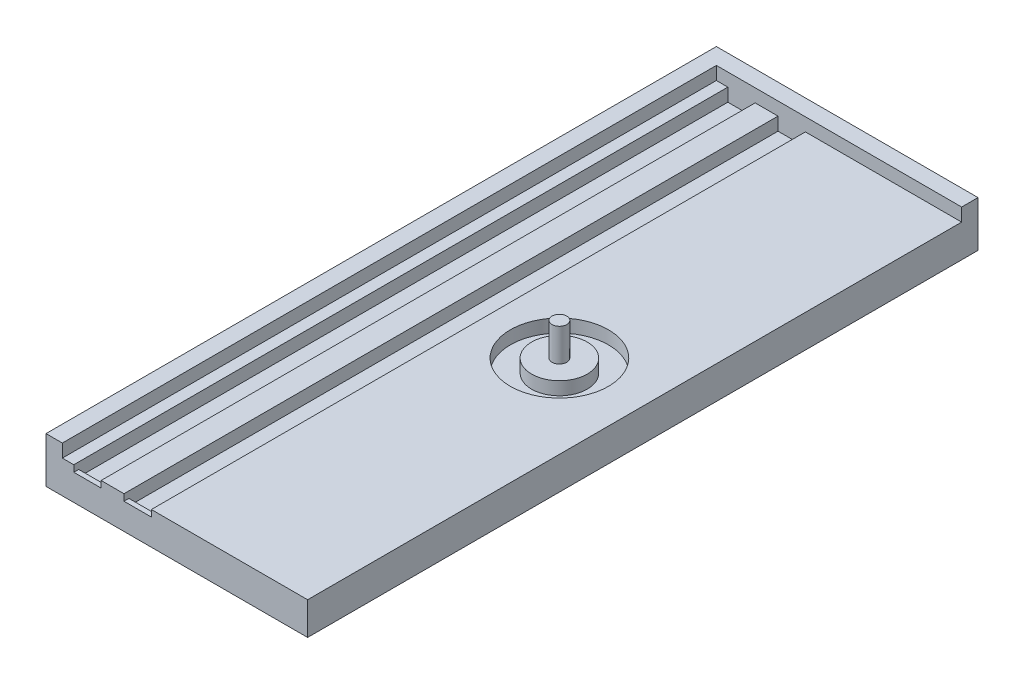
ISO-10303-21;
HEADER;
FILE_DESCRIPTION(('STEP AP214'),'2;1');
FILE_NAME('part.step','',(''),(''),'','','');
FILE_SCHEMA(('AUTOMOTIVE_DESIGN { 1 0 10303 214 1 1 1 1 }'));
ENDSEC;
DATA;
#1=APPLICATION_CONTEXT('core data for automotive mechanical design processes');
#2=APPLICATION_PROTOCOL_DEFINITION('international standard','automotive_design',2000,#1);
#3=PRODUCT_CONTEXT('',#1,'mechanical');
#4=PRODUCT('Part','Part','',(#3));
#5=PRODUCT_RELATED_PRODUCT_CATEGORY('part','',(#4));
#6=PRODUCT_DEFINITION_FORMATION('','',#4);
#7=PRODUCT_DEFINITION_CONTEXT('part definition',#1,'design');
#8=PRODUCT_DEFINITION('design','',#6,#7);
#9=PRODUCT_DEFINITION_SHAPE('','',#8);
#10=(LENGTH_UNIT() NAMED_UNIT(*) SI_UNIT(.MILLI.,.METRE.));
#11=(NAMED_UNIT(*) PLANE_ANGLE_UNIT() SI_UNIT($,.RADIAN.));
#12=(NAMED_UNIT(*) SI_UNIT($,.STERADIAN.) SOLID_ANGLE_UNIT());
#13=UNCERTAINTY_MEASURE_WITH_UNIT(LENGTH_MEASURE(1.E-05),#10,'distance_accuracy_value','');
#14=(GEOMETRIC_REPRESENTATION_CONTEXT(3) GLOBAL_UNCERTAINTY_ASSIGNED_CONTEXT((#13)) GLOBAL_UNIT_ASSIGNED_CONTEXT((#10,
#11,#12)) REPRESENTATION_CONTEXT('',''));
#15=CARTESIAN_POINT('',(0.,0.,0.));
#16=DIRECTION('',(0.,0.,1.));
#17=DIRECTION('',(1.,0.,0.));
#18=AXIS2_PLACEMENT_3D('',#15,#16,#17);
#19=CARTESIAN_POINT('',(0.,6.,0.));
#20=DIRECTION('',(0.,1.,0.));
#21=DIRECTION('',(0.,0.,1.));
#22=AXIS2_PLACEMENT_3D('',#19,#20,#21);
#23=PLANE('',#22);
#24=DIRECTION('',(0.,0.,1.));
#25=VECTOR('',#24,1.);
#26=CARTESIAN_POINT('',(-31.5,6.,-97.5));
#27=LINE('',#26,#25);
#28=CARTESIAN_POINT('',(-31.5,6.,-97.5));
#29=VERTEX_POINT('',#28);
#30=CARTESIAN_POINT('',(-31.5,6.,101.));
#31=VERTEX_POINT('',#30);
#32=EDGE_CURVE('E182',#29,#31,#27,.T.);
#33=ORIENTED_EDGE('',*,*,#32,.T.);
#34=DIRECTION('',(1.,0.,0.));
#35=VECTOR('',#34,1.);
#36=CARTESIAN_POINT('',(-31.5,6.,101.));
#37=LINE('',#36,#35);
#38=CARTESIAN_POINT('',(-23.15,6.,101.));
#39=VERTEX_POINT('',#38);
#40=EDGE_CURVE('E178',#31,#39,#37,.T.);
#41=ORIENTED_EDGE('',*,*,#40,.T.);
#42=DIRECTION('',(0.,0.,-1.));
#43=VECTOR('',#42,1.);
#44=CARTESIAN_POINT('',(-23.15,6.,-97.5));
#45=LINE('',#44,#43);
#46=CARTESIAN_POINT('',(-23.15,6.,-97.5));
#47=VERTEX_POINT('',#46);
#48=EDGE_CURVE('E172',#39,#47,#45,.T.);
#49=ORIENTED_EDGE('',*,*,#48,.T.);
#50=DIRECTION('',(-1.,0.,0.));
#51=VECTOR('',#50,1.);
#52=CARTESIAN_POINT('',(-31.5,6.,-97.5));
#53=LINE('',#52,#51);
#54=EDGE_CURVE('E176',#47,#29,#53,.T.);
#55=ORIENTED_EDGE('',*,*,#54,.T.);
#56=EDGE_LOOP('',(#33,#41,#49,#55));
#57=FACE_BOUND('',#56,.T.);
#58=ADVANCED_FACE('F41',(#57),#23,.T.);
#59=CARTESIAN_POINT('',(0.,10.,0.));
#60=DIRECTION('',(0.,1.,0.));
#61=DIRECTION('',(0.,0.,1.));
#62=AXIS2_PLACEMENT_3D('',#59,#60,#61);
#63=PLANE('',#62);
#64=DIRECTION('',(0.,0.,1.));
#65=VECTOR('',#64,1.);
#66=CARTESIAN_POINT('',(-31.5,10.,-97.5));
#67=LINE('',#66,#65);
#68=CARTESIAN_POINT('',(-31.5,10.,-97.5));
#69=VERTEX_POINT('',#68);
#70=CARTESIAN_POINT('',(-31.5,10.,102.5));
#71=VERTEX_POINT('',#70);
#72=EDGE_CURVE('E206',#69,#71,#67,.T.);
#73=ORIENTED_EDGE('',*,*,#72,.F.);
#74=DIRECTION('',(1.,0.,0.));
#75=VECTOR('',#74,1.);
#76=CARTESIAN_POINT('',(40.,10.,-97.5));
#77=LINE('',#76,#75);
#78=CARTESIAN_POINT('',(-35.,10.,-97.5));
#79=VERTEX_POINT('',#78);
#80=EDGE_CURVE('E253',#79,#69,#77,.T.);
#81=ORIENTED_EDGE('',*,*,#80,.F.);
#82=DIRECTION('',(0.,0.,-1.));
#83=VECTOR('',#82,1.);
#84=CARTESIAN_POINT('',(-35.,10.,-97.5));
#85=LINE('',#84,#83);
#86=CARTESIAN_POINT('',(-35.,10.,102.5));
#87=VERTEX_POINT('',#86);
#88=EDGE_CURVE('E213',#87,#79,#85,.T.);
#89=ORIENTED_EDGE('',*,*,#88,.F.);
#90=DIRECTION('',(1.,0.,0.));
#91=VECTOR('',#90,1.);
#92=CARTESIAN_POINT('',(40.,10.,102.5));
#93=LINE('',#92,#91);
#94=EDGE_CURVE('E290',#87,#71,#93,.T.);
#95=ORIENTED_EDGE('',*,*,#94,.T.);
#96=EDGE_LOOP('',(#73,#81,#89,#95));
#97=FACE_BOUND('',#96,.T.);
#98=ADVANCED_FACE('F490',(#97),#63,.T.);
#99=CARTESIAN_POINT('',(14.5,10.,0.));
#100=DIRECTION('',(0.,1.,0.));
#101=DIRECTION('',(0.,0.,1.));
#102=AXIS2_PLACEMENT_3D('',#99,#100,#101);
#103=CIRCLE('',#102,15.);
#104=CARTESIAN_POINT('',(14.5,10.,15.));
#105=VERTEX_POINT('',#104);
#106=EDGE_CURVE('E441',#105,#105,#103,.T.);
#107=ORIENTED_EDGE('',*,*,#106,.F.);
#108=EDGE_LOOP('',(#107));
#109=FACE_BOUND('',#108,.T.);
#110=DIRECTION('',(0.,0.,-1.));
#111=VECTOR('',#110,1.);
#112=CARTESIAN_POINT('',(-7.78000000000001,10.,102.5));
#113=LINE('',#112,#111);
#114=CARTESIAN_POINT('',(-7.78000000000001,10.,102.5));
#115=VERTEX_POINT('',#114);
#116=CARTESIAN_POINT('',(-7.78000000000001,10.,-97.5));
#117=VERTEX_POINT('',#116);
#118=EDGE_CURVE('E232',#115,#117,#113,.T.);
#119=ORIENTED_EDGE('',*,*,#118,.F.);
#120=CARTESIAN_POINT('',(40.,10.,102.5));
#121=VERTEX_POINT('',#120);
#122=EDGE_CURVE('E296',#115,#121,#93,.T.);
#123=ORIENTED_EDGE('',*,*,#122,.T.);
#124=DIRECTION('',(0.,0.,-1.));
#125=VECTOR('',#124,1.);
#126=CARTESIAN_POINT('',(40.,10.,102.5));
#127=LINE('',#126,#125);
#128=CARTESIAN_POINT('',(40.,10.,-97.4999999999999));
#129=VERTEX_POINT('',#128);
#130=EDGE_CURVE('E294',#121,#129,#127,.T.);
#131=ORIENTED_EDGE('',*,*,#130,.T.);
#132=EDGE_CURVE('E274',#117,#129,#77,.T.);
#133=ORIENTED_EDGE('',*,*,#132,.F.);
#134=EDGE_LOOP('',(#119,#123,#131,#133));
#135=FACE_BOUND('',#134,.T.);
#136=ADVANCED_FACE('F356',(#109,#135),#63,.T.);
#137=CARTESIAN_POINT('',(-40.,10.,102.5));
#138=DIRECTION('',(1.,0.,0.));
#139=DIRECTION('',(0.,0.,-1.));
#140=AXIS2_PLACEMENT_3D('',#137,#138,#139);
#141=PLANE('',#140);
#142=DIRECTION('',(0.,0.,1.));
#143=VECTOR('',#142,1.);
#144=CARTESIAN_POINT('',(-40.,0.,102.5));
#145=LINE('',#144,#143);
#146=CARTESIAN_POINT('',(-40.,0.,-102.5));
#147=VERTEX_POINT('',#146);
#148=CARTESIAN_POINT('',(-40.,0.,102.5));
#149=VERTEX_POINT('',#148);
#150=EDGE_CURVE('E289',#147,#149,#145,.T.);
#151=ORIENTED_EDGE('',*,*,#150,.T.);
#152=DIRECTION('',(0.,-1.,0.));
#153=VECTOR('',#152,1.);
#154=CARTESIAN_POINT('',(-40.,10.,102.5));
#155=LINE('',#154,#153);
#156=CARTESIAN_POINT('',(-40.,14.,102.5));
#157=VERTEX_POINT('',#156);
#158=EDGE_CURVE('E45',#157,#149,#155,.T.);
#159=ORIENTED_EDGE('',*,*,#158,.F.);
#160=DIRECTION('',(0.,0.,1.));
#161=VECTOR('',#160,1.);
#162=CARTESIAN_POINT('',(-40.,14.,-102.5));
#163=LINE('',#162,#161);
#164=CARTESIAN_POINT('',(-40.,14.,-102.5));
#165=VERTEX_POINT('',#164);
#166=EDGE_CURVE('E257',#165,#157,#163,.T.);
#167=ORIENTED_EDGE('',*,*,#166,.F.);
#168=DIRECTION('',(0.,-1.,0.));
#169=VECTOR('',#168,1.);
#170=CARTESIAN_POINT('',(-40.,10.,-102.5));
#171=LINE('',#170,#169);
#172=EDGE_CURVE('E300',#165,#147,#171,.T.);
#173=ORIENTED_EDGE('',*,*,#172,.T.);
#174=EDGE_LOOP('',(#151,#159,#167,#173));
#175=FACE_BOUND('',#174,.T.);
#176=ADVANCED_FACE('F43',(#175),#141,.F.);
#177=CARTESIAN_POINT('',(40.,10.,102.5));
#178=DIRECTION('',(0.,0.,-1.));
#179=DIRECTION('',(-1.,0.,0.));
#180=AXIS2_PLACEMENT_3D('',#177,#178,#179);
#181=PLANE('',#180);
#182=DIRECTION('',(-1.,0.,0.));
#183=VECTOR('',#182,1.);
#184=CARTESIAN_POINT('',(-31.5,8.,102.5));
#185=LINE('',#184,#183);
#186=CARTESIAN_POINT('',(-23.15,8.,102.5));
#187=VERTEX_POINT('',#186);
#188=CARTESIAN_POINT('',(-31.5,8.,102.5));
#189=VERTEX_POINT('',#188);
#190=EDGE_CURVE('E415',#187,#189,#185,.T.);
#191=ORIENTED_EDGE('',*,*,#190,.T.);
#192=DIRECTION('',(0.,1.,0.));
#193=VECTOR('',#192,1.);
#194=CARTESIAN_POINT('',(-31.5,6.,102.5));
#195=LINE('',#194,#193);
#196=EDGE_CURVE('E63',#189,#71,#195,.T.);
#197=ORIENTED_EDGE('',*,*,#196,.T.);
#198=ORIENTED_EDGE('',*,*,#94,.F.);
#199=DIRECTION('',(0.,-1.,0.));
#200=VECTOR('',#199,1.);
#201=CARTESIAN_POINT('',(-35.,14.,102.5));
#202=LINE('',#201,#200);
#203=CARTESIAN_POINT('',(-35.,14.,102.5));
#204=VERTEX_POINT('',#203);
#205=EDGE_CURVE('E285',#204,#87,#202,.T.);
#206=ORIENTED_EDGE('',*,*,#205,.F.);
#207=DIRECTION('',(1.,0.,0.));
#208=VECTOR('',#207,1.);
#209=CARTESIAN_POINT('',(-35.,14.,102.5));
#210=LINE('',#209,#208);
#211=EDGE_CURVE('E261',#157,#204,#210,.T.);
#212=ORIENTED_EDGE('',*,*,#211,.F.);
#213=ORIENTED_EDGE('',*,*,#158,.T.);
#214=DIRECTION('',(1.,0.,0.));
#215=VECTOR('',#214,1.);
#216=CARTESIAN_POINT('',(40.,0.,102.5));
#217=LINE('',#216,#215);
#218=CARTESIAN_POINT('',(40.,0.,102.5));
#219=VERTEX_POINT('',#218);
#220=EDGE_CURVE('E304',#149,#219,#217,.T.);
#221=ORIENTED_EDGE('',*,*,#220,.T.);
#222=DIRECTION('',(0.,-1.,0.));
#223=VECTOR('',#222,1.);
#224=CARTESIAN_POINT('',(40.,10.,102.5));
#225=LINE('',#224,#223);
#226=EDGE_CURVE('E319',#121,#219,#225,.T.);
#227=ORIENTED_EDGE('',*,*,#226,.F.);
#228=ORIENTED_EDGE('',*,*,#122,.F.);
#229=DIRECTION('',(0.,1.,0.));
#230=VECTOR('',#229,1.);
#231=CARTESIAN_POINT('',(-7.78000000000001,6.,102.5));
#232=LINE('',#231,#230);
#233=CARTESIAN_POINT('',(-7.78000000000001,8.,102.5));
#234=VERTEX_POINT('',#233);
#235=EDGE_CURVE('E224',#234,#115,#232,.T.);
#236=ORIENTED_EDGE('',*,*,#235,.F.);
#237=DIRECTION('',(-1.,0.,0.));
#238=VECTOR('',#237,1.);
#239=CARTESIAN_POINT('',(-16.15,8.,102.5));
#240=LINE('',#239,#238);
#241=CARTESIAN_POINT('',(-16.15,8.,102.5));
#242=VERTEX_POINT('',#241);
#243=EDGE_CURVE('E372',#234,#242,#240,.T.);
#244=ORIENTED_EDGE('',*,*,#243,.T.);
#245=DIRECTION('',(0.,1.,0.));
#246=VECTOR('',#245,1.);
#247=CARTESIAN_POINT('',(-16.15,6.,102.5));
#248=LINE('',#247,#246);
#249=CARTESIAN_POINT('',(-16.15,10.,102.5));
#250=VERTEX_POINT('',#249);
#251=EDGE_CURVE('E221',#242,#250,#248,.T.);
#252=ORIENTED_EDGE('',*,*,#251,.T.);
#253=CARTESIAN_POINT('',(-23.15,10.,102.5));
#254=VERTEX_POINT('',#253);
#255=EDGE_CURVE('E295',#254,#250,#93,.T.);
#256=ORIENTED_EDGE('',*,*,#255,.F.);
#257=DIRECTION('',(0.,1.,0.));
#258=VECTOR('',#257,1.);
#259=CARTESIAN_POINT('',(-23.15,6.,102.5));
#260=LINE('',#259,#258);
#261=EDGE_CURVE('E194',#187,#254,#260,.T.);
#262=ORIENTED_EDGE('',*,*,#261,.F.);
#263=EDGE_LOOP('',(#191,#197,#198,#206,#212,#213,#221,#227,#228,#236,#244,#252,#256,#262));
#264=FACE_BOUND('',#263,.T.);
#265=ADVANCED_FACE('F333',(#264),#181,.F.);
#266=CARTESIAN_POINT('',(40.,10.,102.5));
#267=DIRECTION('',(-1.,0.,0.));
#268=DIRECTION('',(0.,0.,1.));
#269=AXIS2_PLACEMENT_3D('',#266,#267,#268);
#270=PLANE('',#269);
#271=DIRECTION('',(0.,0.,-1.));
#272=VECTOR('',#271,1.);
#273=CARTESIAN_POINT('',(40.,0.,102.5));
#274=LINE('',#273,#272);
#275=CARTESIAN_POINT('',(40.,0.,-102.5));
#276=VERTEX_POINT('',#275);
#277=EDGE_CURVE('E307',#219,#276,#274,.T.);
#278=ORIENTED_EDGE('',*,*,#277,.T.);
#279=DIRECTION('',(0.,-1.,0.));
#280=VECTOR('',#279,1.);
#281=CARTESIAN_POINT('',(40.,10.,-102.5));
#282=LINE('',#281,#280);
#283=CARTESIAN_POINT('',(40.,14.,-102.5));
#284=VERTEX_POINT('',#283);
#285=EDGE_CURVE('E316',#284,#276,#282,.T.);
#286=ORIENTED_EDGE('',*,*,#285,.F.);
#287=DIRECTION('',(0.,0.,-1.));
#288=VECTOR('',#287,1.);
#289=CARTESIAN_POINT('',(40.,14.,-97.5));
#290=LINE('',#289,#288);
#291=CARTESIAN_POINT('',(40.,14.,-97.5));
#292=VERTEX_POINT('',#291);
#293=EDGE_CURVE('E248',#292,#284,#290,.T.);
#294=ORIENTED_EDGE('',*,*,#293,.F.);
#295=DIRECTION('',(0.,-1.,0.));
#296=VECTOR('',#295,1.);
#297=CARTESIAN_POINT('',(40.,14.,-97.5));
#298=LINE('',#297,#296);
#299=EDGE_CURVE('E270',#292,#129,#298,.T.);
#300=ORIENTED_EDGE('',*,*,#299,.T.);
#301=ORIENTED_EDGE('',*,*,#130,.F.);
#302=ORIENTED_EDGE('',*,*,#226,.T.);
#303=EDGE_LOOP('',(#278,#286,#294,#300,#301,#302));
#304=FACE_BOUND('',#303,.T.);
#305=ADVANCED_FACE('F341',(#304),#270,.F.);
#306=CARTESIAN_POINT('',(40.,10.,-102.5));
#307=DIRECTION('',(0.,0.,1.));
#308=DIRECTION('',(1.,0.,0.));
#309=AXIS2_PLACEMENT_3D('',#306,#307,#308);
#310=PLANE('',#309);
#311=DIRECTION('',(-1.,0.,0.));
#312=VECTOR('',#311,1.);
#313=CARTESIAN_POINT('',(40.,0.,-102.5));
#314=LINE('',#313,#312);
#315=EDGE_CURVE('E310',#276,#147,#314,.T.);
#316=ORIENTED_EDGE('',*,*,#315,.T.);
#317=ORIENTED_EDGE('',*,*,#172,.F.);
#318=DIRECTION('',(-1.,0.,0.));
#319=VECTOR('',#318,1.);
#320=CARTESIAN_POINT('',(40.,14.,-102.5));
#321=LINE('',#320,#319);
#322=EDGE_CURVE('E252',#284,#165,#321,.T.);
#323=ORIENTED_EDGE('',*,*,#322,.F.);
#324=ORIENTED_EDGE('',*,*,#285,.T.);
#325=EDGE_LOOP('',(#316,#317,#323,#324));
#326=FACE_BOUND('',#325,.T.);
#327=ADVANCED_FACE('F345',(#326),#310,.F.);
#328=DIRECTION('',(0.,0.,-1.));
#329=VECTOR('',#328,1.);
#330=CARTESIAN_POINT('',(-23.15,10.,-97.5));
#331=LINE('',#330,#329);
#332=CARTESIAN_POINT('',(-23.15,10.,-97.5));
#333=VERTEX_POINT('',#332);
#334=EDGE_CURVE('E188',#254,#333,#331,.T.);
#335=ORIENTED_EDGE('',*,*,#334,.F.);
#336=ORIENTED_EDGE('',*,*,#255,.T.);
#337=DIRECTION('',(0.,0.,1.));
#338=VECTOR('',#337,1.);
#339=CARTESIAN_POINT('',(-16.15,10.,-97.5));
#340=LINE('',#339,#338);
#341=CARTESIAN_POINT('',(-16.15,10.,-97.5));
#342=VERTEX_POINT('',#341);
#343=EDGE_CURVE('E209',#342,#250,#340,.T.);
#344=ORIENTED_EDGE('',*,*,#343,.F.);
#345=EDGE_CURVE('E277',#333,#342,#77,.T.);
#346=ORIENTED_EDGE('',*,*,#345,.F.);
#347=EDGE_LOOP('',(#335,#336,#344,#346));
#348=FACE_BOUND('',#347,.T.);
#349=ADVANCED_FACE('F367',(#348),#63,.T.);
#350=CARTESIAN_POINT('',(0.,0.,0.));
#351=DIRECTION('',(0.,1.,0.));
#352=DIRECTION('',(0.,0.,1.));
#353=AXIS2_PLACEMENT_3D('',#350,#351,#352);
#354=PLANE('',#353);
#355=ORIENTED_EDGE('',*,*,#150,.F.);
#356=ORIENTED_EDGE('',*,*,#315,.F.);
#357=ORIENTED_EDGE('',*,*,#277,.F.);
#358=ORIENTED_EDGE('',*,*,#220,.F.);
#359=EDGE_LOOP('',(#355,#356,#357,#358));
#360=FACE_BOUND('',#359,.T.);
#361=ADVANCED_FACE('F340',(#360),#354,.F.);
#362=CARTESIAN_POINT('',(-35.,14.,-97.5));
#363=DIRECTION('',(-1.,0.,0.));
#364=DIRECTION('',(0.,0.,1.));
#365=AXIS2_PLACEMENT_3D('',#362,#363,#364);
#366=PLANE('',#365);
#367=ORIENTED_EDGE('',*,*,#88,.T.);
#368=DIRECTION('',(0.,-1.,0.));
#369=VECTOR('',#368,1.);
#370=CARTESIAN_POINT('',(-35.,14.,-97.5));
#371=LINE('',#370,#369);
#372=CARTESIAN_POINT('',(-35.,14.,-97.5));
#373=VERTEX_POINT('',#372);
#374=EDGE_CURVE('E281',#373,#79,#371,.T.);
#375=ORIENTED_EDGE('',*,*,#374,.F.);
#376=DIRECTION('',(0.,0.,-1.));
#377=VECTOR('',#376,1.);
#378=CARTESIAN_POINT('',(-35.,14.,-97.5));
#379=LINE('',#378,#377);
#380=EDGE_CURVE('E264',#204,#373,#379,.T.);
#381=ORIENTED_EDGE('',*,*,#380,.F.);
#382=ORIENTED_EDGE('',*,*,#205,.T.);
#383=EDGE_LOOP('',(#367,#375,#381,#382));
#384=FACE_BOUND('',#383,.T.);
#385=ADVANCED_FACE('F519',(#384),#366,.F.);
#386=CARTESIAN_POINT('',(40.,14.,-97.5));
#387=DIRECTION('',(0.,0.,-1.));
#388=DIRECTION('',(-1.,0.,0.));
#389=AXIS2_PLACEMENT_3D('',#386,#387,#388);
#390=PLANE('',#389);
#391=ORIENTED_EDGE('',*,*,#80,.T.);
#392=DIRECTION('',(0.,1.,0.));
#393=VECTOR('',#392,1.);
#394=CARTESIAN_POINT('',(-31.5,6.,-97.5));
#395=LINE('',#394,#393);
#396=EDGE_CURVE('E193',#29,#69,#395,.T.);
#397=ORIENTED_EDGE('',*,*,#396,.F.);
#398=ORIENTED_EDGE('',*,*,#54,.F.);
#399=DIRECTION('',(0.,1.,0.));
#400=VECTOR('',#399,1.);
#401=CARTESIAN_POINT('',(-23.15,6.,-97.5));
#402=LINE('',#401,#400);
#403=EDGE_CURVE('E185',#47,#333,#402,.T.);
#404=ORIENTED_EDGE('',*,*,#403,.T.);
#405=ORIENTED_EDGE('',*,*,#345,.T.);
#406=DIRECTION('',(0.,1.,0.));
#407=VECTOR('',#406,1.);
#408=CARTESIAN_POINT('',(-16.15,6.,-97.5));
#409=LINE('',#408,#407);
#410=CARTESIAN_POINT('',(-16.15,6.,-97.5));
#411=VERTEX_POINT('',#410);
#412=EDGE_CURVE('E217',#411,#342,#409,.T.);
#413=ORIENTED_EDGE('',*,*,#412,.F.);
#414=DIRECTION('',(-1.,0.,0.));
#415=VECTOR('',#414,1.);
#416=CARTESIAN_POINT('',(-7.78000000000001,6.,-97.5));
#417=LINE('',#416,#415);
#418=CARTESIAN_POINT('',(-7.78000000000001,6.,-97.5));
#419=VERTEX_POINT('',#418);
#420=EDGE_CURVE('E235',#419,#411,#417,.T.);
#421=ORIENTED_EDGE('',*,*,#420,.F.);
#422=DIRECTION('',(0.,1.,0.));
#423=VECTOR('',#422,1.);
#424=CARTESIAN_POINT('',(-7.78000000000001,6.,-97.5));
#425=LINE('',#424,#423);
#426=EDGE_CURVE('E227',#419,#117,#425,.T.);
#427=ORIENTED_EDGE('',*,*,#426,.T.);
#428=ORIENTED_EDGE('',*,*,#132,.T.);
#429=ORIENTED_EDGE('',*,*,#299,.F.);
#430=DIRECTION('',(1.,0.,0.));
#431=VECTOR('',#430,1.);
#432=CARTESIAN_POINT('',(40.,14.,-97.5));
#433=LINE('',#432,#431);
#434=EDGE_CURVE('E267',#373,#292,#433,.T.);
#435=ORIENTED_EDGE('',*,*,#434,.F.);
#436=ORIENTED_EDGE('',*,*,#374,.T.);
#437=EDGE_LOOP('',(#391,#397,#398,#404,#405,#413,#421,#427,#428,#429,#435,#436));
#438=FACE_BOUND('',#437,.T.);
#439=ADVANCED_FACE('F197',(#438),#390,.F.);
#440=CARTESIAN_POINT('',(0.,14.,0.));
#441=DIRECTION('',(0.,1.,0.));
#442=DIRECTION('',(0.,0.,1.));
#443=AXIS2_PLACEMENT_3D('',#440,#441,#442);
#444=PLANE('',#443);
#445=ORIENTED_EDGE('',*,*,#293,.T.);
#446=ORIENTED_EDGE('',*,*,#322,.T.);
#447=ORIENTED_EDGE('',*,*,#166,.T.);
#448=ORIENTED_EDGE('',*,*,#211,.T.);
#449=ORIENTED_EDGE('',*,*,#380,.T.);
#450=ORIENTED_EDGE('',*,*,#434,.T.);
#451=EDGE_LOOP('',(#445,#446,#447,#448,#449,#450));
#452=FACE_BOUND('',#451,.T.);
#453=ADVANCED_FACE('F347',(#452),#444,.T.);
#454=CARTESIAN_POINT('',(-7.78000000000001,6.,102.5));
#455=DIRECTION('',(1.,0.,0.));
#456=DIRECTION('',(0.,0.,-1.));
#457=AXIS2_PLACEMENT_3D('',#454,#455,#456);
#458=PLANE('',#457);
#459=DIRECTION('',(0.,1.,0.));
#460=VECTOR('',#459,1.);
#461=CARTESIAN_POINT('',(-7.78000000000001,6.,101.));
#462=LINE('',#461,#460);
#463=CARTESIAN_POINT('',(-7.78000000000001,6.,101.));
#464=VERTEX_POINT('',#463);
#465=CARTESIAN_POINT('',(-7.78000000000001,8.,101.));
#466=VERTEX_POINT('',#465);
#467=EDGE_CURVE('E420',#464,#466,#462,.T.);
#468=ORIENTED_EDGE('',*,*,#467,.T.);
#469=DIRECTION('',(0.,0.,1.));
#470=VECTOR('',#469,1.);
#471=CARTESIAN_POINT('',(-7.78000000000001,8.,101.));
#472=LINE('',#471,#470);
#473=EDGE_CURVE('E408',#466,#234,#472,.T.);
#474=ORIENTED_EDGE('',*,*,#473,.T.);
#475=ORIENTED_EDGE('',*,*,#235,.T.);
#476=ORIENTED_EDGE('',*,*,#118,.T.);
#477=ORIENTED_EDGE('',*,*,#426,.F.);
#478=DIRECTION('',(0.,0.,-1.));
#479=VECTOR('',#478,1.);
#480=CARTESIAN_POINT('',(-7.78000000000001,6.,102.5));
#481=LINE('',#480,#479);
#482=EDGE_CURVE('E220',#464,#419,#481,.T.);
#483=ORIENTED_EDGE('',*,*,#482,.F.);
#484=EDGE_LOOP('',(#468,#474,#475,#476,#477,#483));
#485=FACE_BOUND('',#484,.T.);
#486=ADVANCED_FACE('F406',(#485),#458,.F.);
#487=CARTESIAN_POINT('',(-16.15,6.,-97.5));
#488=DIRECTION('',(-1.,0.,0.));
#489=DIRECTION('',(0.,0.,1.));
#490=AXIS2_PLACEMENT_3D('',#487,#488,#489);
#491=PLANE('',#490);
#492=ORIENTED_EDGE('',*,*,#251,.F.);
#493=DIRECTION('',(0.,0.,1.));
#494=VECTOR('',#493,1.);
#495=CARTESIAN_POINT('',(-16.15,8.,101.));
#496=LINE('',#495,#494);
#497=CARTESIAN_POINT('',(-16.15,8.,101.));
#498=VERTEX_POINT('',#497);
#499=EDGE_CURVE('E413',#498,#242,#496,.T.);
#500=ORIENTED_EDGE('',*,*,#499,.F.);
#501=DIRECTION('',(0.,-1.,0.));
#502=VECTOR('',#501,1.);
#503=CARTESIAN_POINT('',(-16.15,6.,101.));
#504=LINE('',#503,#502);
#505=CARTESIAN_POINT('',(-16.15,6.,101.));
#506=VERTEX_POINT('',#505);
#507=EDGE_CURVE('E426',#498,#506,#504,.T.);
#508=ORIENTED_EDGE('',*,*,#507,.T.);
#509=DIRECTION('',(0.,0.,1.));
#510=VECTOR('',#509,1.);
#511=CARTESIAN_POINT('',(-16.15,6.,-97.5));
#512=LINE('',#511,#510);
#513=EDGE_CURVE('E241',#411,#506,#512,.T.);
#514=ORIENTED_EDGE('',*,*,#513,.F.);
#515=ORIENTED_EDGE('',*,*,#412,.T.);
#516=ORIENTED_EDGE('',*,*,#343,.T.);
#517=EDGE_LOOP('',(#492,#500,#508,#514,#515,#516));
#518=FACE_BOUND('',#517,.T.);
#519=ADVANCED_FACE('F375',(#518),#491,.F.);
#520=CARTESIAN_POINT('',(0.,6.,0.));
#521=DIRECTION('',(0.,1.,0.));
#522=DIRECTION('',(0.,0.,1.));
#523=AXIS2_PLACEMENT_3D('',#520,#521,#522);
#524=PLANE('',#523);
#525=DIRECTION('',(1.,0.,0.));
#526=VECTOR('',#525,1.);
#527=CARTESIAN_POINT('',(-7.78000000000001,6.,101.));
#528=LINE('',#527,#526);
#529=EDGE_CURVE('E403',#506,#464,#528,.T.);
#530=ORIENTED_EDGE('',*,*,#529,.T.);
#531=ORIENTED_EDGE('',*,*,#482,.T.);
#532=ORIENTED_EDGE('',*,*,#420,.T.);
#533=ORIENTED_EDGE('',*,*,#513,.T.);
#534=EDGE_LOOP('',(#530,#531,#532,#533));
#535=FACE_BOUND('',#534,.T.);
#536=ADVANCED_FACE('F400',(#535),#524,.T.);
#537=CARTESIAN_POINT('',(-31.5,6.,-97.5));
#538=DIRECTION('',(-1.,0.,0.));
#539=DIRECTION('',(0.,0.,1.));
#540=AXIS2_PLACEMENT_3D('',#537,#538,#539);
#541=PLANE('',#540);
#542=ORIENTED_EDGE('',*,*,#196,.F.);
#543=DIRECTION('',(0.,0.,1.));
#544=VECTOR('',#543,1.);
#545=CARTESIAN_POINT('',(-31.5,8.,101.));
#546=LINE('',#545,#544);
#547=CARTESIAN_POINT('',(-31.5,8.,101.));
#548=VERTEX_POINT('',#547);
#549=EDGE_CURVE('E58',#548,#189,#546,.T.);
#550=ORIENTED_EDGE('',*,*,#549,.F.);
#551=DIRECTION('',(0.,-1.,0.));
#552=VECTOR('',#551,1.);
#553=CARTESIAN_POINT('',(-31.5,6.,101.));
#554=LINE('',#553,#552);
#555=EDGE_CURVE('E455',#548,#31,#554,.T.);
#556=ORIENTED_EDGE('',*,*,#555,.T.);
#557=ORIENTED_EDGE('',*,*,#32,.F.);
#558=ORIENTED_EDGE('',*,*,#396,.T.);
#559=ORIENTED_EDGE('',*,*,#72,.T.);
#560=EDGE_LOOP('',(#542,#550,#556,#557,#558,#559));
#561=FACE_BOUND('',#560,.T.);
#562=ADVANCED_FACE('F506',(#561),#541,.F.);
#563=CARTESIAN_POINT('',(-23.15,6.,-97.5));
#564=DIRECTION('',(1.,0.,0.));
#565=DIRECTION('',(0.,0.,-1.));
#566=AXIS2_PLACEMENT_3D('',#563,#564,#565);
#567=PLANE('',#566);
#568=DIRECTION('',(0.,1.,0.));
#569=VECTOR('',#568,1.);
#570=CARTESIAN_POINT('',(-23.15,6.,101.));
#571=LINE('',#570,#569);
#572=CARTESIAN_POINT('',(-23.15,8.,101.));
#573=VERTEX_POINT('',#572);
#574=EDGE_CURVE('E457',#39,#573,#571,.T.);
#575=ORIENTED_EDGE('',*,*,#574,.T.);
#576=DIRECTION('',(0.,0.,1.));
#577=VECTOR('',#576,1.);
#578=CARTESIAN_POINT('',(-23.15,8.,101.));
#579=LINE('',#578,#577);
#580=EDGE_CURVE('E748',#573,#187,#579,.T.);
#581=ORIENTED_EDGE('',*,*,#580,.T.);
#582=ORIENTED_EDGE('',*,*,#261,.T.);
#583=ORIENTED_EDGE('',*,*,#334,.T.);
#584=ORIENTED_EDGE('',*,*,#403,.F.);
#585=ORIENTED_EDGE('',*,*,#48,.F.);
#586=EDGE_LOOP('',(#575,#581,#582,#583,#584,#585));
#587=FACE_BOUND('',#586,.T.);
#588=ADVANCED_FACE('F186',(#587),#567,.F.);
#589=CARTESIAN_POINT('',(14.5,6.,0.));
#590=DIRECTION('',(0.,1.,0.));
#591=DIRECTION('',(0.,0.,1.));
#592=AXIS2_PLACEMENT_3D('',#589,#590,#591);
#593=CYLINDRICAL_SURFACE('',#592,15.);
#594=CARTESIAN_POINT('',(14.5,6.,0.));
#595=DIRECTION('',(0.,1.,0.));
#596=DIRECTION('',(0.,0.,1.));
#597=AXIS2_PLACEMENT_3D('',#594,#595,#596);
#598=CIRCLE('',#597,15.);
#599=CARTESIAN_POINT('',(14.5,6.,15.));
#600=VERTEX_POINT('',#599);
#601=EDGE_CURVE('E231',#600,#600,#598,.T.);
#602=ORIENTED_EDGE('',*,*,#601,.F.);
#603=EDGE_LOOP('',(#602));
#604=FACE_BOUND('',#603,.T.);
#605=ORIENTED_EDGE('',*,*,#106,.T.);
#606=EDGE_LOOP('',(#605));
#607=FACE_BOUND('',#606,.T.);
#608=ADVANCED_FACE('F502',(#604,#607),#593,.F.);
#609=CARTESIAN_POINT('',(14.5,6.,0.));
#610=DIRECTION('',(0.,1.,0.));
#611=DIRECTION('',(0.,0.,1.));
#612=AXIS2_PLACEMENT_3D('',#609,#610,#611);
#613=PLANE('',#612);
#614=CARTESIAN_POINT('',(14.5,6.,0.));
#615=DIRECTION('',(0.,1.,0.));
#616=DIRECTION('',(0.,0.,1.));
#617=AXIS2_PLACEMENT_3D('',#614,#615,#616);
#618=CIRCLE('',#617,8.5);
#619=CARTESIAN_POINT('',(14.5,6.,8.5));
#620=VERTEX_POINT('',#619);
#621=EDGE_CURVE('E437',#620,#620,#618,.T.);
#622=ORIENTED_EDGE('',*,*,#621,.F.);
#623=EDGE_LOOP('',(#622));
#624=FACE_BOUND('',#623,.T.);
#625=ORIENTED_EDGE('',*,*,#601,.T.);
#626=EDGE_LOOP('',(#625));
#627=FACE_BOUND('',#626,.T.);
#628=ADVANCED_FACE('F541',(#624,#627),#613,.T.);
#629=CARTESIAN_POINT('',(14.5,6.,0.));
#630=DIRECTION('',(0.,1.,0.));
#631=DIRECTION('',(0.,0.,1.));
#632=AXIS2_PLACEMENT_3D('',#629,#630,#631);
#633=CYLINDRICAL_SURFACE('',#632,8.5);
#634=ORIENTED_EDGE('',*,*,#621,.T.);
#635=EDGE_LOOP('',(#634));
#636=FACE_BOUND('',#635,.T.);
#637=CARTESIAN_POINT('',(14.5,10.,0.));
#638=DIRECTION('',(0.,1.,0.));
#639=DIRECTION('',(0.,0.,1.));
#640=AXIS2_PLACEMENT_3D('',#637,#638,#639);
#641=CIRCLE('',#640,8.5);
#642=CARTESIAN_POINT('',(14.5,10.,8.5));
#643=VERTEX_POINT('',#642);
#644=EDGE_CURVE('E435',#643,#643,#641,.T.);
#645=ORIENTED_EDGE('',*,*,#644,.F.);
#646=EDGE_LOOP('',(#645));
#647=FACE_BOUND('',#646,.T.);
#648=ADVANCED_FACE('F546',(#636,#647),#633,.T.);
#649=CARTESIAN_POINT('',(14.5,10.,0.));
#650=DIRECTION('',(0.,1.,0.));
#651=DIRECTION('',(0.,0.,1.));
#652=AXIS2_PLACEMENT_3D('',#649,#650,#651);
#653=CIRCLE('',#652,2.25);
#654=CARTESIAN_POINT('',(14.5,10.,2.25));
#655=VERTEX_POINT('',#654);
#656=EDGE_CURVE('E11',#655,#655,#653,.T.);
#657=ORIENTED_EDGE('',*,*,#656,.F.);
#658=EDGE_LOOP('',(#657));
#659=FACE_BOUND('',#658,.T.);
#660=ORIENTED_EDGE('',*,*,#644,.T.);
#661=EDGE_LOOP('',(#660));
#662=FACE_BOUND('',#661,.T.);
#663=ADVANCED_FACE('F499',(#659,#662),#63,.T.);
#664=CARTESIAN_POINT('',(14.5,20.,0.));
#665=DIRECTION('',(0.,-1.,0.));
#666=DIRECTION('',(0.,0.,-1.));
#667=AXIS2_PLACEMENT_3D('',#664,#665,#666);
#668=CYLINDRICAL_SURFACE('',#667,2.25);
#669=CARTESIAN_POINT('',(14.5,20.,0.));
#670=DIRECTION('',(0.,1.,0.));
#671=DIRECTION('',(0.,0.,1.));
#672=AXIS2_PLACEMENT_3D('',#669,#670,#671);
#673=CIRCLE('',#672,2.25);
#674=CARTESIAN_POINT('',(14.5,20.,2.25));
#675=VERTEX_POINT('',#674);
#676=EDGE_CURVE('E430',#675,#675,#673,.T.);
#677=ORIENTED_EDGE('',*,*,#676,.F.);
#678=EDGE_LOOP('',(#677));
#679=FACE_BOUND('',#678,.T.);
#680=ORIENTED_EDGE('',*,*,#656,.T.);
#681=EDGE_LOOP('',(#680));
#682=FACE_BOUND('',#681,.T.);
#683=ADVANCED_FACE('F557',(#679,#682),#668,.T.);
#684=CARTESIAN_POINT('',(14.5,20.,0.));
#685=DIRECTION('',(0.,1.,0.));
#686=DIRECTION('',(0.,0.,1.));
#687=AXIS2_PLACEMENT_3D('',#684,#685,#686);
#688=PLANE('',#687);
#689=ORIENTED_EDGE('',*,*,#676,.T.);
#690=EDGE_LOOP('',(#689));
#691=FACE_BOUND('',#690,.T.);
#692=ADVANCED_FACE('F486',(#691),#688,.T.);
#693=CARTESIAN_POINT('',(-16.15,8.,101.));
#694=DIRECTION('',(0.,1.,0.));
#695=DIRECTION('',(-1.,0.,0.));
#696=AXIS2_PLACEMENT_3D('',#693,#694,#695);
#697=PLANE('',#696);
#698=ORIENTED_EDGE('',*,*,#243,.F.);
#699=ORIENTED_EDGE('',*,*,#473,.F.);
#700=DIRECTION('',(-1.,0.,0.));
#701=VECTOR('',#700,1.);
#702=CARTESIAN_POINT('',(-16.15,8.,101.));
#703=LINE('',#702,#701);
#704=EDGE_CURVE('E469',#466,#498,#703,.T.);
#705=ORIENTED_EDGE('',*,*,#704,.T.);
#706=ORIENTED_EDGE('',*,*,#499,.T.);
#707=EDGE_LOOP('',(#698,#699,#705,#706));
#708=FACE_BOUND('',#707,.T.);
#709=ADVANCED_FACE('F410',(#708),#697,.T.);
#710=CARTESIAN_POINT('',(0.,0.,101.));
#711=DIRECTION('',(0.,0.,-1.));
#712=DIRECTION('',(-1.,0.,0.));
#713=AXIS2_PLACEMENT_3D('',#710,#711,#712);
#714=PLANE('',#713);
#715=ORIENTED_EDGE('',*,*,#529,.F.);
#716=ORIENTED_EDGE('',*,*,#507,.F.);
#717=ORIENTED_EDGE('',*,*,#704,.F.);
#718=ORIENTED_EDGE('',*,*,#467,.F.);
#719=EDGE_LOOP('',(#715,#716,#717,#718));
#720=FACE_BOUND('',#719,.T.);
#721=ADVANCED_FACE('F476',(#720),#714,.T.);
#722=CARTESIAN_POINT('',(-31.5,8.,101.));
#723=DIRECTION('',(0.,1.,0.));
#724=DIRECTION('',(0.,0.,1.));
#725=AXIS2_PLACEMENT_3D('',#722,#723,#724);
#726=PLANE('',#725);
#727=ORIENTED_EDGE('',*,*,#190,.F.);
#728=ORIENTED_EDGE('',*,*,#580,.F.);
#729=DIRECTION('',(-1.,0.,0.));
#730=VECTOR('',#729,1.);
#731=CARTESIAN_POINT('',(-31.5,8.,101.));
#732=LINE('',#731,#730);
#733=EDGE_CURVE('E422',#573,#548,#732,.T.);
#734=ORIENTED_EDGE('',*,*,#733,.T.);
#735=ORIENTED_EDGE('',*,*,#549,.T.);
#736=EDGE_LOOP('',(#727,#728,#734,#735));
#737=FACE_BOUND('',#736,.T.);
#738=ADVANCED_FACE('F478',(#737),#726,.T.);
#739=CARTESIAN_POINT('',(0.,0.,101.));
#740=DIRECTION('',(0.,0.,1.));
#741=DIRECTION('',(1.,0.,0.));
#742=AXIS2_PLACEMENT_3D('',#739,#740,#741);
#743=PLANE('',#742);
#744=ORIENTED_EDGE('',*,*,#733,.F.);
#745=ORIENTED_EDGE('',*,*,#574,.F.);
#746=ORIENTED_EDGE('',*,*,#40,.F.);
#747=ORIENTED_EDGE('',*,*,#555,.F.);
#748=EDGE_LOOP('',(#744,#745,#746,#747));
#749=FACE_BOUND('',#748,.T.);
#750=ADVANCED_FACE('F454',(#749),#743,.F.);
#751=CLOSED_SHELL('',(#58,#98,#136,#176,#265,#305,#327,#349,#361,#385,#439,#453,#486,#519,#536,
#562,#588,#608,#628,#648,#663,#683,#692,#709,#721,#738,#750));
#752=MANIFOLD_SOLID_BREP('B2',#751);
#753=ADVANCED_BREP_SHAPE_REPRESENTATION('',(#18,#752),#14);
#754=SHAPE_DEFINITION_REPRESENTATION(#9,#753);
ENDSEC;
END-ISO-10303-21;
